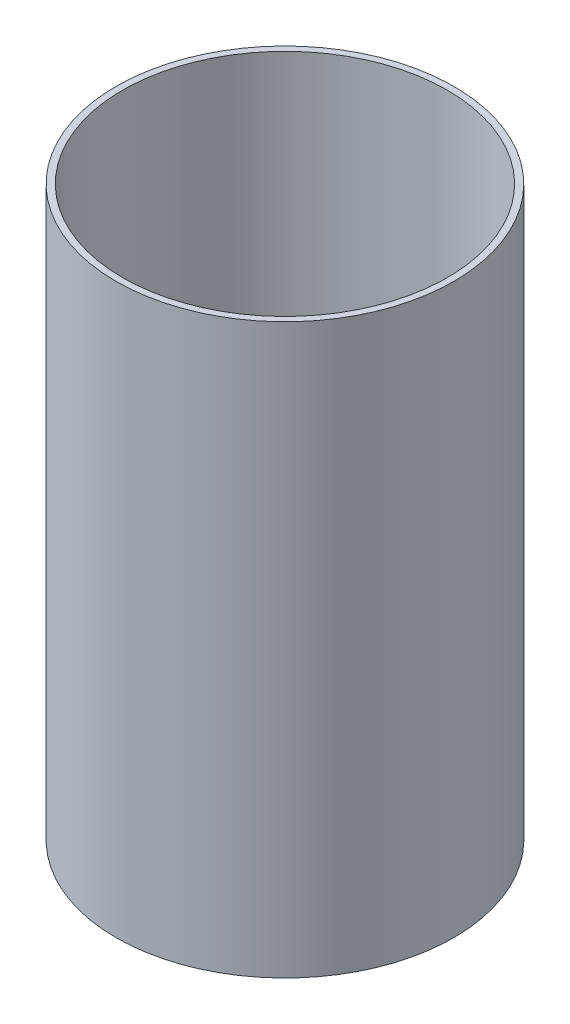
from build123d import *

# Parameters (mm, degrees)
SKETCH2_W = 1.524
SKETCH2_H = 133.35


with BuildPart() as part:
    # Sketch2 → Revolve1 (revolve)
    with BuildSketch(Plane.XY, mode=Mode.PRIVATE) as revolve1_sk:
        with Locations((-38.862, -66.675)):
            Rectangle(SKETCH2_W, SKETCH2_H)
    revolve(revolve1_sk.sketch.rotate(Axis((0, 55, 0), (0, -1, 0)), 270), axis=Axis((0, 55, 0), (0, -1, 0)))


solid = part.part
